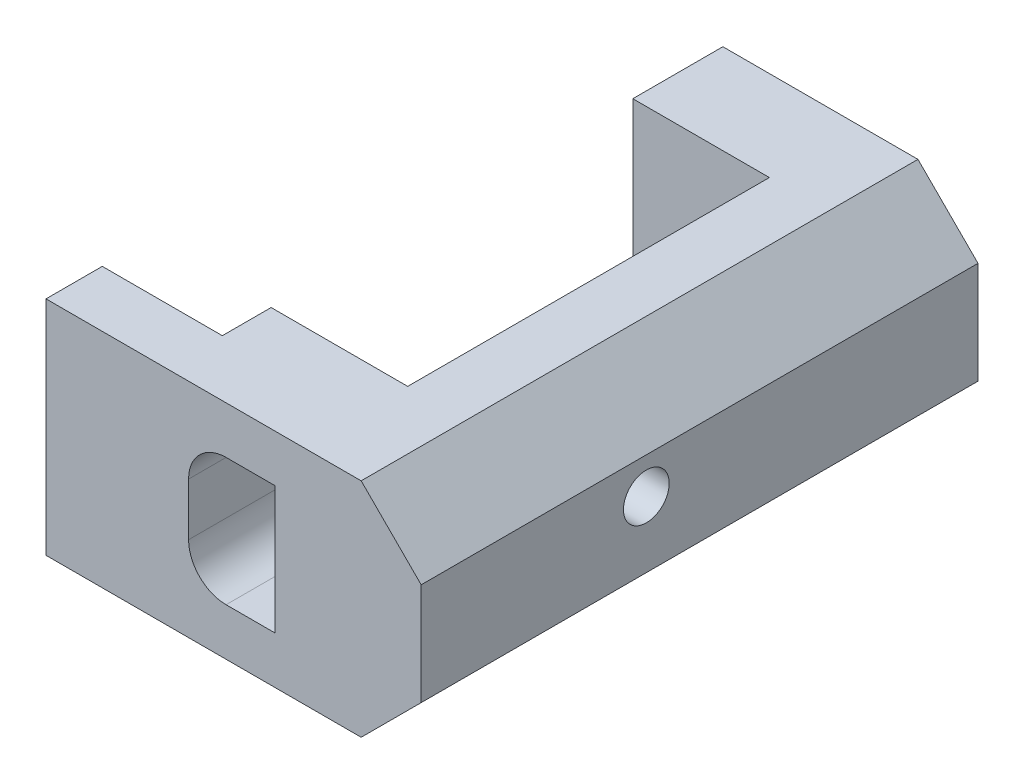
from build123d import *

# Parameters (mm, degrees)
BOSS_EXTRUDE1_DEPTH = 14.8
SKETCH3_R           = 1.5
CUT_EXTRUDE2_DEPTH  = 10
CUT_EXTRUDE4_DEPTH  = 2.5
BOSS_EXTRUDE2_DEPTH = 3
SKETCH6_W           = 3.75
SKETCH6_H           = 14.8
BOSS_EXTRUDE3_DEPTH = 8
CUT_EXTRUDE7_DEPTH  = 8
BOSS_EXTRUDE4_DEPTH = 1
SKETCH11_R          = 1
CUT_EXTRUDE8_DEPTH  = 6
SKETCH12_W          = 9.1
SKETCH12_H          = 14.8
CUT_EXTRUDE9_DEPTH  = 1
SKETCH15_W          = 37.1
SKETCH15_H          = 14.8
BOSS_EXTRUDE5_DEPTH = 4
CHAMFER1_SIZE       = 4
SKETCH16_R          = 1.525
CUT_EXTRUDE10_DEPTH = 45.797879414


with BuildPart() as part:
    # Sketch1 → Boss-Extrude1 (new body)
    with BuildSketch(Plane(origin=(0, 0, 0), x_dir=(1, 0, 0), z_dir=(0, 1, 0))):
        Polygon((0, 0), (13, 0), (13, 33.1), (0, 33.1), (0, 28.1), (9.1, 28.1), (9.1, 5), (0, 5), align=None)
    extrude(amount=BOSS_EXTRUDE1_DEPTH)

    # Sketch3 → Cut-Extrude2 (cut)
    with BuildSketch(Plane(origin=(13, 0, 0), x_dir=(0, 0, -1), z_dir=(1, 0, 0))):
        with Locations((12, 8.4)):
            Circle(SKETCH3_R)
    extrude(amount=-CUT_EXTRUDE2_DEPTH, mode=Mode.SUBTRACT)

    # Sketch5 → Cut-Extrude4 (cut)
    with BuildSketch(Plane.ZY.offset(-9.1)):
        Polygon((-11.738621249, 11.689632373), (-14.718215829, 10.271176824), (-14.979594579, 6.981544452), (-12.261378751, 5.110367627), (-9.281784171, 6.528823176), (-9.020405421, 9.818455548), align=None)
    extrude(amount=-CUT_EXTRUDE4_DEPTH, mode=Mode.SUBTRACT)

    # Sketch7 → Boss-Extrude2 (add)
    with BuildSketch(Plane.XY):
        Polygon((13, 0.1), (12.9, 0), (13, 0), align=None)
        Polygon((13, 14.8), (12.9, 14.8), (13, 14.7), align=None)
        Polygon((0, 14.8), (0, 0), (12.9, 0), (13, 0.1), (13, 14.7), (12.9, 14.8), align=None)
    extrude(amount=BOSS_EXTRUDE2_DEPTH)

    # Sketch6 → Boss-Extrude3 (add)
    with BuildSketch(Plane.ZY):
        with Locations((1.125, 7.4)):
            Rectangle(SKETCH6_W, SKETCH6_H)
    extrude(amount=BOSS_EXTRUDE3_DEPTH)

    # Sketch8 → Cut-Extrude7 (cut)
    with BuildSketch(Plane.XY.offset(3)):
        with BuildLine():
            Line((7.25, 11.65), (7.25, 3.15))
            Line((7.25, 3.15), (4, 3.15))
            ThreePointArc((4, 3.15), (2.232233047, 3.882233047), (1.5, 5.65))
            Line((1.5, 5.65), (1.5, 9.15))
            ThreePointArc((1.5, 9.15), (2.232233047, 10.917766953), (4, 11.65))
            Line((4, 11.65), (7.25, 11.65))
        make_face()
    extrude(amount=-CUT_EXTRUDE7_DEPTH, mode=Mode.SUBTRACT)

    # Sketch10 → Boss-Extrude4 (add)
    with BuildSketch(Plane(origin=(0, 0, -33.1), x_dir=(-1, 0, 0), z_dir=(0, 0, -1))):
        Polygon((-13, 14.7), (-12.9, 14.8), (-13, 14.8), align=None)
        Polygon((0, 0), (0, 14.8), (-12.9, 14.8), (-13, 14.7), (-13, 0.1), (-12.9, 0), align=None)
        Polygon((-13, 0), (-12.9, 0), (-13, 0.1), align=None)
    extrude(amount=BOSS_EXTRUDE4_DEPTH)

    # Sketch11 → Cut-Extrude8 (cut)
    with BuildSketch(Plane.ZY):
        with Locations((-31.1, 8.4)):
            Circle(SKETCH11_R)
    extrude(amount=-CUT_EXTRUDE8_DEPTH, mode=Mode.SUBTRACT)

    # Sketch12 → Cut-Extrude9 (cut)
    with BuildSketch(Plane(origin=(0, 0, -5), x_dir=(-1, 0, 0), z_dir=(0, 0, -1))):
        with Locations((-4.55, 7.4)):
            Rectangle(SKETCH12_W, SKETCH12_H)
    extrude(amount=-CUT_EXTRUDE9_DEPTH, mode=Mode.SUBTRACT)

    # Sketch15 → Boss-Extrude5 (add)
    with BuildSketch(Plane(origin=(13, 0, 0), x_dir=(0, 0, -1), z_dir=(1, 0, 0))):
        with Locations((15.55, 7.4)):
            Rectangle(SKETCH15_W, SKETCH15_H)
    extrude(amount=BOSS_EXTRUDE5_DEPTH)

    # Chamfer1
    chamfer1_edges = [part.edges().sort_by_distance(p)[0] for p in [
        (17, 0, -15.55),
        (17, 14.8, -15.55),
    ]]
    chamfer(chamfer1_edges, length=CHAMFER1_SIZE)

    # Sketch16 → Cut-Extrude10 (cut, through all)
    with BuildSketch(Plane(origin=(17, 0, 0), x_dir=(0, 0, -1), z_dir=(1, 0, 0))):
        with Locations((12, 8.4)):
            Circle(SKETCH16_R)
    extrude(amount=-CUT_EXTRUDE10_DEPTH, mode=Mode.SUBTRACT)


solid = part.part
